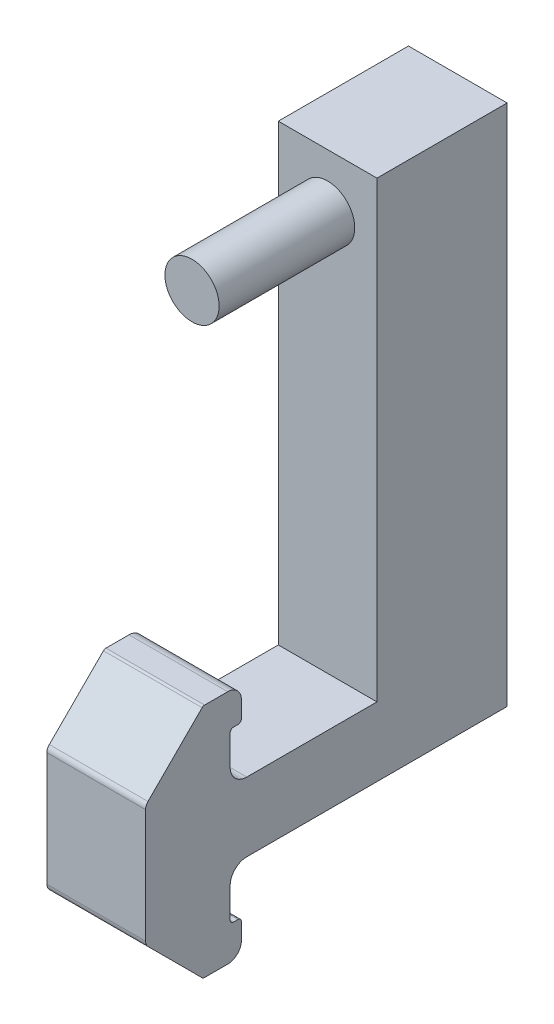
ISO-10303-21;
HEADER;
FILE_DESCRIPTION(('STEP AP214'),'2;1');
FILE_NAME('part.step','',(''),(''),'','','');
FILE_SCHEMA(('AUTOMOTIVE_DESIGN { 1 0 10303 214 1 1 1 1 }'));
ENDSEC;
DATA;
#1=APPLICATION_CONTEXT('core data for automotive mechanical design processes');
#2=APPLICATION_PROTOCOL_DEFINITION('international standard','automotive_design',2000,#1);
#3=PRODUCT_CONTEXT('',#1,'mechanical');
#4=PRODUCT('Part','Part','',(#3));
#5=PRODUCT_RELATED_PRODUCT_CATEGORY('part','',(#4));
#6=PRODUCT_DEFINITION_FORMATION('','',#4);
#7=PRODUCT_DEFINITION_CONTEXT('part definition',#1,'design');
#8=PRODUCT_DEFINITION('design','',#6,#7);
#9=PRODUCT_DEFINITION_SHAPE('','',#8);
#10=(LENGTH_UNIT() NAMED_UNIT(*) SI_UNIT(.MILLI.,.METRE.));
#11=(NAMED_UNIT(*) PLANE_ANGLE_UNIT() SI_UNIT($,.RADIAN.));
#12=(NAMED_UNIT(*) SI_UNIT($,.STERADIAN.) SOLID_ANGLE_UNIT());
#13=UNCERTAINTY_MEASURE_WITH_UNIT(LENGTH_MEASURE(1.E-05),#10,'distance_accuracy_value','');
#14=(GEOMETRIC_REPRESENTATION_CONTEXT(3) GLOBAL_UNCERTAINTY_ASSIGNED_CONTEXT((#13)) GLOBAL_UNIT_ASSIGNED_CONTEXT((#10,
#11,#12)) REPRESENTATION_CONTEXT('',''));
#15=CARTESIAN_POINT('',(0.,0.,0.));
#16=DIRECTION('',(0.,0.,1.));
#17=DIRECTION('',(1.,0.,0.));
#18=AXIS2_PLACEMENT_3D('',#15,#16,#17);
#19=CARTESIAN_POINT('',(0.,0.,12.5));
#20=DIRECTION('',(0.,0.,-1.));
#21=DIRECTION('',(-1.,0.,0.));
#22=AXIS2_PLACEMENT_3D('',#19,#20,#21);
#23=CYLINDRICAL_SURFACE('',#22,2.5);
#24=CARTESIAN_POINT('',(0.,0.,12.5));
#25=DIRECTION('',(0.,0.,1.));
#26=DIRECTION('',(1.,0.,0.));
#27=AXIS2_PLACEMENT_3D('',#24,#25,#26);
#28=CIRCLE('',#27,2.5);
#29=CARTESIAN_POINT('',(2.5,0.,12.5));
#30=VERTEX_POINT('',#29);
#31=EDGE_CURVE('E11',#30,#30,#28,.T.);
#32=ORIENTED_EDGE('',*,*,#31,.F.);
#33=EDGE_LOOP('',(#32));
#34=FACE_BOUND('',#33,.T.);
#35=CARTESIAN_POINT('',(0.,0.,0.));
#36=DIRECTION('',(0.,0.,1.));
#37=DIRECTION('',(1.,0.,0.));
#38=AXIS2_PLACEMENT_3D('',#35,#36,#37);
#39=CIRCLE('',#38,2.5);
#40=CARTESIAN_POINT('',(2.5,0.,0.));
#41=VERTEX_POINT('',#40);
#42=EDGE_CURVE('E44',#41,#41,#39,.T.);
#43=ORIENTED_EDGE('',*,*,#42,.T.);
#44=EDGE_LOOP('',(#43));
#45=FACE_BOUND('',#44,.T.);
#46=ADVANCED_FACE('F41',(#34,#45),#23,.T.);
#47=CARTESIAN_POINT('',(0.,0.,12.5));
#48=DIRECTION('',(0.,0.,1.));
#49=DIRECTION('',(1.,0.,0.));
#50=AXIS2_PLACEMENT_3D('',#47,#48,#49);
#51=PLANE('',#50);
#52=ORIENTED_EDGE('',*,*,#31,.T.);
#53=EDGE_LOOP('',(#52));
#54=FACE_BOUND('',#53,.T.);
#55=ADVANCED_FACE('F122',(#54),#51,.T.);
#56=CARTESIAN_POINT('',(-4.54662107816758,5.,-12.));
#57=DIRECTION('',(1.,0.,0.));
#58=DIRECTION('',(0.,0.,-1.));
#59=AXIS2_PLACEMENT_3D('',#56,#57,#58);
#60=PLANE('',#59);
#61=DIRECTION('',(0.,1.,0.));
#62=VECTOR('',#61,1.);
#63=CARTESIAN_POINT('',(-4.54662107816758,0.,-12.));
#64=LINE('',#63,#62);
#65=CARTESIAN_POINT('',(-4.54662107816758,-43.1849999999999,-12.));
#66=VERTEX_POINT('',#65);
#67=CARTESIAN_POINT('',(-4.54662107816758,5.,-12.));
#68=VERTEX_POINT('',#67);
#69=EDGE_CURVE('E99',#66,#68,#64,.T.);
#70=ORIENTED_EDGE('',*,*,#69,.F.);
#71=DIRECTION('',(0.,0.,1.));
#72=VECTOR('',#71,1.);
#73=CARTESIAN_POINT('',(-4.54662107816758,-43.1849999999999,0.));
#74=LINE('',#73,#72);
#75=CARTESIAN_POINT('',(-4.54662107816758,-43.1849999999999,12.));
#76=VERTEX_POINT('',#75);
#77=EDGE_CURVE('E444',#66,#76,#74,.T.);
#78=ORIENTED_EDGE('',*,*,#77,.T.);
#79=CARTESIAN_POINT('',(-4.54662107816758,-44.7149999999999,12.));
#80=DIRECTION('',(1.,0.,0.));
#81=DIRECTION('',(0.,0.,-1.));
#82=AXIS2_PLACEMENT_3D('',#79,#80,#81);
#83=CIRCLE('',#82,1.53);
#84=CARTESIAN_POINT('',(-4.54662107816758,-44.7149999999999,13.53));
#85=VERTEX_POINT('',#84);
#86=EDGE_CURVE('E448',#76,#85,#83,.T.);
#87=ORIENTED_EDGE('',*,*,#86,.T.);
#88=DIRECTION('',(0.,-1.,0.));
#89=VECTOR('',#88,1.);
#90=CARTESIAN_POINT('',(-4.54662107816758,-47.4649999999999,13.53));
#91=LINE('',#90,#89);
#92=CARTESIAN_POINT('',(-4.54662107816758,-47.4649999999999,13.53));
#93=VERTEX_POINT('',#92);
#94=EDGE_CURVE('E787',#85,#93,#91,.T.);
#95=ORIENTED_EDGE('',*,*,#94,.T.);
#96=CARTESIAN_POINT('',(-4.54662107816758,-47.4649999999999,13.21));
#97=DIRECTION('',(1.,0.,0.));
#98=DIRECTION('',(0.,0.,-1.));
#99=AXIS2_PLACEMENT_3D('',#96,#97,#98);
#100=CIRCLE('',#99,0.320000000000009);
#101=CARTESIAN_POINT('',(-4.54662107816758,-47.7849999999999,13.21));
#102=VERTEX_POINT('',#101);
#103=EDGE_CURVE('E789',#93,#102,#100,.T.);
#104=ORIENTED_EDGE('',*,*,#103,.T.);
#105=DIRECTION('',(0.,-1.04083408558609E-13,-1.));
#106=VECTOR('',#105,1.);
#107=CARTESIAN_POINT('',(-4.54662107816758,-47.785,12.81));
#108=LINE('',#107,#106);
#109=CARTESIAN_POINT('',(-4.54662107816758,-47.785,12.81));
#110=VERTEX_POINT('',#109);
#111=EDGE_CURVE('E791',#102,#110,#108,.T.);
#112=ORIENTED_EDGE('',*,*,#111,.T.);
#113=CARTESIAN_POINT('',(-4.54662107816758,-48.105,12.8100000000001));
#114=DIRECTION('',(1.,0.,0.));
#115=DIRECTION('',(0.,0.,-1.));
#116=AXIS2_PLACEMENT_3D('',#113,#114,#115);
#117=CIRCLE('',#116,0.320000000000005);
#118=CARTESIAN_POINT('',(-4.54662107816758,-48.105,12.4900000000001));
#119=VERTEX_POINT('',#118);
#120=EDGE_CURVE('E697',#110,#119,#117,.F.);
#121=ORIENTED_EDGE('',*,*,#120,.T.);
#122=DIRECTION('',(0.,-1.,0.));
#123=VECTOR('',#122,1.);
#124=CARTESIAN_POINT('',(-4.54662107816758,-49.605,12.4900000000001));
#125=LINE('',#124,#123);
#126=CARTESIAN_POINT('',(-4.54662107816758,-49.605,12.4900000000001));
#127=VERTEX_POINT('',#126);
#128=EDGE_CURVE('E694',#119,#127,#125,.T.);
#129=ORIENTED_EDGE('',*,*,#128,.T.);
#130=CARTESIAN_POINT('',(-4.54662107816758,-49.605,13.7600000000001));
#131=DIRECTION('',(1.,0.,0.));
#132=DIRECTION('',(0.,0.,-1.));
#133=AXIS2_PLACEMENT_3D('',#130,#131,#132);
#134=CIRCLE('',#133,1.27);
#135=CARTESIAN_POINT('',(-4.54662107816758,-50.875,13.7600000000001));
#136=VERTEX_POINT('',#135);
#137=EDGE_CURVE('E564',#127,#136,#134,.F.);
#138=ORIENTED_EDGE('',*,*,#137,.T.);
#139=DIRECTION('',(0.,0.,1.));
#140=VECTOR('',#139,1.);
#141=CARTESIAN_POINT('',(-4.54662107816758,-50.875,15.8900000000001));
#142=LINE('',#141,#140);
#143=CARTESIAN_POINT('',(-4.54662107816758,-50.875,15.8900000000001));
#144=VERTEX_POINT('',#143);
#145=EDGE_CURVE('E406',#136,#144,#142,.T.);
#146=ORIENTED_EDGE('',*,*,#145,.T.);
#147=CARTESIAN_POINT('',(-4.54662107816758,-50.555,15.8900000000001));
#148=DIRECTION('',(1.,0.,0.));
#149=DIRECTION('',(0.,0.,-1.));
#150=AXIS2_PLACEMENT_3D('',#147,#148,#149);
#151=CIRCLE('',#150,0.320000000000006);
#152=CARTESIAN_POINT('',(-4.54662107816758,-50.7812741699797,16.1162741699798));
#153=VERTEX_POINT('',#152);
#154=EDGE_CURVE('E420',#144,#153,#151,.F.);
#155=ORIENTED_EDGE('',*,*,#154,.T.);
#156=DIRECTION('',(0.,0.707106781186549,0.707106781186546));
#157=VECTOR('',#156,1.);
#158=CARTESIAN_POINT('',(-4.54662107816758,-45.7888153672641,21.1087329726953));
#159=LINE('',#158,#157);
#160=CARTESIAN_POINT('',(-4.54662107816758,-45.7888153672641,21.1087329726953));
#161=VERTEX_POINT('',#160);
#162=EDGE_CURVE('E422',#153,#161,#159,.T.);
#163=ORIENTED_EDGE('',*,*,#162,.T.);
#164=CARTESIAN_POINT('',(-4.54662107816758,-45.25,20.5699176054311));
#165=DIRECTION('',(1.,0.,0.));
#166=DIRECTION('',(0.,0.,-1.));
#167=AXIS2_PLACEMENT_3D('',#164,#165,#166);
#168=CIRCLE('',#167,0.761999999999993);
#169=CARTESIAN_POINT('',(-4.54662107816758,-45.25,21.3319176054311));
#170=VERTEX_POINT('',#169);
#171=EDGE_CURVE('E483',#161,#170,#168,.F.);
#172=ORIENTED_EDGE('',*,*,#171,.T.);
#173=DIRECTION('',(0.,1.,0.));
#174=VECTOR('',#173,1.);
#175=CARTESIAN_POINT('',(-4.54662107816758,-34.75,21.3319176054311));
#176=LINE('',#175,#174);
#177=CARTESIAN_POINT('',(-4.54662107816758,-34.75,21.3319176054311));
#178=VERTEX_POINT('',#177);
#179=EDGE_CURVE('E480',#170,#178,#176,.T.);
#180=ORIENTED_EDGE('',*,*,#179,.T.);
#181=CARTESIAN_POINT('',(-4.54662107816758,-34.75,20.5699176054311));
#182=DIRECTION('',(1.,0.,0.));
#183=DIRECTION('',(0.,0.,-1.));
#184=AXIS2_PLACEMENT_3D('',#181,#182,#183);
#185=CIRCLE('',#184,0.761999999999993);
#186=CARTESIAN_POINT('',(-4.54662107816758,-34.2111846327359,21.1087329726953));
#187=VERTEX_POINT('',#186);
#188=EDGE_CURVE('E477',#178,#187,#185,.F.);
#189=ORIENTED_EDGE('',*,*,#188,.T.);
#190=DIRECTION('',(0.,0.70710678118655,-0.707106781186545));
#191=VECTOR('',#190,1.);
#192=CARTESIAN_POINT('',(-4.54662107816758,-29.2187258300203,16.1162741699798));
#193=LINE('',#192,#191);
#194=CARTESIAN_POINT('',(-4.54662107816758,-29.2187258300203,16.1162741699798));
#195=VERTEX_POINT('',#194);
#196=EDGE_CURVE('E474',#187,#195,#193,.T.);
#197=ORIENTED_EDGE('',*,*,#196,.T.);
#198=CARTESIAN_POINT('',(-4.54662107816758,-29.4450000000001,15.89));
#199=DIRECTION('',(1.,0.,0.));
#200=DIRECTION('',(0.,0.,-1.));
#201=AXIS2_PLACEMENT_3D('',#198,#199,#200);
#202=CIRCLE('',#201,0.320000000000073);
#203=CARTESIAN_POINT('',(-4.54662107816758,-29.125,15.89));
#204=VERTEX_POINT('',#203);
#205=EDGE_CURVE('E471',#195,#204,#202,.F.);
#206=ORIENTED_EDGE('',*,*,#205,.T.);
#207=DIRECTION('',(0.,0.,-1.));
#208=VECTOR('',#207,1.);
#209=CARTESIAN_POINT('',(-4.54662107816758,-29.125,15.89));
#210=LINE('',#209,#208);
#211=CARTESIAN_POINT('',(-4.54662107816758,-29.125,13.76));
#212=VERTEX_POINT('',#211);
#213=EDGE_CURVE('E468',#204,#212,#210,.T.);
#214=ORIENTED_EDGE('',*,*,#213,.T.);
#215=CARTESIAN_POINT('',(-4.54662107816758,-30.395,13.76));
#216=DIRECTION('',(1.,0.,0.));
#217=DIRECTION('',(0.,0.,-1.));
#218=AXIS2_PLACEMENT_3D('',#215,#216,#217);
#219=CIRCLE('',#218,1.26999999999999);
#220=CARTESIAN_POINT('',(-4.54662107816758,-30.395,12.49));
#221=VERTEX_POINT('',#220);
#222=EDGE_CURVE('E465',#212,#221,#219,.F.);
#223=ORIENTED_EDGE('',*,*,#222,.T.);
#224=DIRECTION('',(0.,-1.,0.));
#225=VECTOR('',#224,1.);
#226=CARTESIAN_POINT('',(-4.54662107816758,-30.395,12.49));
#227=LINE('',#226,#225);
#228=CARTESIAN_POINT('',(-4.54662107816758,-31.895,12.49));
#229=VERTEX_POINT('',#228);
#230=EDGE_CURVE('E462',#221,#229,#227,.T.);
#231=ORIENTED_EDGE('',*,*,#230,.T.);
#232=CARTESIAN_POINT('',(-4.54662107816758,-31.895,12.81));
#233=DIRECTION('',(1.,0.,0.));
#234=DIRECTION('',(0.,0.,-1.));
#235=AXIS2_PLACEMENT_3D('',#232,#233,#234);
#236=CIRCLE('',#235,0.32);
#237=CARTESIAN_POINT('',(-4.54662107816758,-32.215,12.81));
#238=VERTEX_POINT('',#237);
#239=EDGE_CURVE('E459',#229,#238,#236,.F.);
#240=ORIENTED_EDGE('',*,*,#239,.T.);
#241=DIRECTION('',(0.,0.,1.));
#242=VECTOR('',#241,1.);
#243=CARTESIAN_POINT('',(-4.54662107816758,-32.215,12.81));
#244=LINE('',#243,#242);
#245=CARTESIAN_POINT('',(-4.54662107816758,-32.215,13.21));
#246=VERTEX_POINT('',#245);
#247=EDGE_CURVE('E456',#238,#246,#244,.T.);
#248=ORIENTED_EDGE('',*,*,#247,.T.);
#249=CARTESIAN_POINT('',(-4.54662107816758,-32.535,13.21));
#250=DIRECTION('',(1.,0.,0.));
#251=DIRECTION('',(0.,0.,-1.));
#252=AXIS2_PLACEMENT_3D('',#249,#250,#251);
#253=CIRCLE('',#252,0.32);
#254=CARTESIAN_POINT('',(-4.54662107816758,-32.535,13.53));
#255=VERTEX_POINT('',#254);
#256=EDGE_CURVE('E453',#246,#255,#253,.T.);
#257=ORIENTED_EDGE('',*,*,#256,.T.);
#258=DIRECTION('',(0.,-1.,0.));
#259=VECTOR('',#258,1.);
#260=CARTESIAN_POINT('',(-4.54662107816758,-32.535,13.53));
#261=LINE('',#260,#259);
#262=CARTESIAN_POINT('',(-4.54662107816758,-35.285,13.53));
#263=VERTEX_POINT('',#262);
#264=EDGE_CURVE('E446',#255,#263,#261,.T.);
#265=ORIENTED_EDGE('',*,*,#264,.T.);
#266=CARTESIAN_POINT('',(-4.54662107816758,-35.285,12.));
#267=DIRECTION('',(1.,0.,0.));
#268=DIRECTION('',(0.,0.,-1.));
#269=AXIS2_PLACEMENT_3D('',#266,#267,#268);
#270=CIRCLE('',#269,1.53);
#271=CARTESIAN_POINT('',(-4.54662107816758,-36.815,12.));
#272=VERTEX_POINT('',#271);
#273=EDGE_CURVE('E441',#263,#272,#270,.T.);
#274=ORIENTED_EDGE('',*,*,#273,.T.);
#275=DIRECTION('',(0.,0.,-1.));
#276=VECTOR('',#275,1.);
#277=CARTESIAN_POINT('',(-4.54662107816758,-36.815,12.));
#278=LINE('',#277,#276);
#279=CARTESIAN_POINT('',(-4.54662107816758,-36.815,0.));
#280=VERTEX_POINT('',#279);
#281=EDGE_CURVE('E437',#272,#280,#278,.T.);
#282=ORIENTED_EDGE('',*,*,#281,.T.);
#283=DIRECTION('',(0.,1.,0.));
#284=VECTOR('',#283,1.);
#285=CARTESIAN_POINT('',(-4.54662107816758,5.,0.));
#286=LINE('',#285,#284);
#287=CARTESIAN_POINT('',(-4.54662107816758,5.,0.));
#288=VERTEX_POINT('',#287);
#289=EDGE_CURVE('E89',#280,#288,#286,.T.);
#290=ORIENTED_EDGE('',*,*,#289,.T.);
#291=DIRECTION('',(0.,0.,1.));
#292=VECTOR('',#291,1.);
#293=CARTESIAN_POINT('',(-4.54662107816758,5.,-12.));
#294=LINE('',#293,#292);
#295=EDGE_CURVE('E84',#68,#288,#294,.T.);
#296=ORIENTED_EDGE('',*,*,#295,.F.);
#297=EDGE_LOOP('',(#70,#78,#87,#95,#104,#112,#121,#129,#138,#146,#155,#163,#172,#180,#189,#197,
#206,#214,#223,#231,#240,#248,#257,#265,#274,#282,#290,#296));
#298=FACE_BOUND('',#297,.T.);
#299=ADVANCED_FACE('F127',(#298),#60,.F.);
#300=CARTESIAN_POINT('',(4.54662107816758,5.,-12.));
#301=DIRECTION('',(0.,-1.,0.));
#302=DIRECTION('',(0.,0.,-1.));
#303=AXIS2_PLACEMENT_3D('',#300,#301,#302);
#304=PLANE('',#303);
#305=DIRECTION('',(1.,0.,0.));
#306=VECTOR('',#305,1.);
#307=CARTESIAN_POINT('',(4.54662107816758,5.,0.));
#308=LINE('',#307,#306);
#309=CARTESIAN_POINT('',(4.54662107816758,5.,0.));
#310=VERTEX_POINT('',#309);
#311=EDGE_CURVE('E79',#288,#310,#308,.T.);
#312=ORIENTED_EDGE('',*,*,#311,.T.);
#313=DIRECTION('',(0.,0.,1.));
#314=VECTOR('',#313,1.);
#315=CARTESIAN_POINT('',(4.54662107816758,5.,-12.));
#316=LINE('',#315,#314);
#317=CARTESIAN_POINT('',(4.54662107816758,5.,-12.));
#318=VERTEX_POINT('',#317);
#319=EDGE_CURVE('E82',#318,#310,#316,.T.);
#320=ORIENTED_EDGE('',*,*,#319,.F.);
#321=DIRECTION('',(1.,0.,0.));
#322=VECTOR('',#321,1.);
#323=CARTESIAN_POINT('',(4.54662107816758,5.,-12.));
#324=LINE('',#323,#322);
#325=EDGE_CURVE('E95',#68,#318,#324,.T.);
#326=ORIENTED_EDGE('',*,*,#325,.F.);
#327=ORIENTED_EDGE('',*,*,#295,.T.);
#328=EDGE_LOOP('',(#312,#320,#326,#327));
#329=FACE_BOUND('',#328,.T.);
#330=ADVANCED_FACE('F80',(#329),#304,.F.);
#331=CARTESIAN_POINT('',(4.54662107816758,0.,-12.));
#332=DIRECTION('',(-1.,0.,0.));
#333=DIRECTION('',(0.,0.,1.));
#334=AXIS2_PLACEMENT_3D('',#331,#332,#333);
#335=PLANE('',#334);
#336=DIRECTION('',(0.,-1.,0.));
#337=VECTOR('',#336,1.);
#338=CARTESIAN_POINT('',(4.54662107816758,0.,0.));
#339=LINE('',#338,#337);
#340=CARTESIAN_POINT('',(4.54662107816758,-36.815,0.));
#341=VERTEX_POINT('',#340);
#342=EDGE_CURVE('E88',#310,#341,#339,.T.);
#343=ORIENTED_EDGE('',*,*,#342,.T.);
#344=DIRECTION('',(0.,0.,1.));
#345=VECTOR('',#344,1.);
#346=CARTESIAN_POINT('',(4.54662107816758,-36.815,12.));
#347=LINE('',#346,#345);
#348=CARTESIAN_POINT('',(4.54662107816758,-36.815,12.));
#349=VERTEX_POINT('',#348);
#350=EDGE_CURVE('E517',#341,#349,#347,.T.);
#351=ORIENTED_EDGE('',*,*,#350,.T.);
#352=CARTESIAN_POINT('',(4.54662107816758,-35.285,12.));
#353=DIRECTION('',(-1.,0.,0.));
#354=DIRECTION('',(0.,0.,-1.));
#355=AXIS2_PLACEMENT_3D('',#352,#353,#354);
#356=CIRCLE('',#355,1.53);
#357=CARTESIAN_POINT('',(4.54662107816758,-35.285,13.53));
#358=VERTEX_POINT('',#357);
#359=EDGE_CURVE('E519',#349,#358,#356,.T.);
#360=ORIENTED_EDGE('',*,*,#359,.T.);
#361=DIRECTION('',(0.,1.,0.));
#362=VECTOR('',#361,1.);
#363=CARTESIAN_POINT('',(4.54662107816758,-32.535,13.53));
#364=LINE('',#363,#362);
#365=CARTESIAN_POINT('',(4.54662107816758,-32.535,13.53));
#366=VERTEX_POINT('',#365);
#367=EDGE_CURVE('E522',#358,#366,#364,.T.);
#368=ORIENTED_EDGE('',*,*,#367,.T.);
#369=CARTESIAN_POINT('',(4.54662107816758,-32.535,13.21));
#370=DIRECTION('',(-1.,0.,0.));
#371=DIRECTION('',(0.,0.,-1.));
#372=AXIS2_PLACEMENT_3D('',#369,#370,#371);
#373=CIRCLE('',#372,0.32);
#374=CARTESIAN_POINT('',(4.54662107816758,-32.215,13.21));
#375=VERTEX_POINT('',#374);
#376=EDGE_CURVE('E525',#366,#375,#373,.T.);
#377=ORIENTED_EDGE('',*,*,#376,.T.);
#378=DIRECTION('',(0.,0.,-1.));
#379=VECTOR('',#378,1.);
#380=CARTESIAN_POINT('',(4.54662107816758,-32.215,12.81));
#381=LINE('',#380,#379);
#382=CARTESIAN_POINT('',(4.54662107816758,-32.215,12.81));
#383=VERTEX_POINT('',#382);
#384=EDGE_CURVE('E528',#375,#383,#381,.T.);
#385=ORIENTED_EDGE('',*,*,#384,.T.);
#386=CARTESIAN_POINT('',(4.54662107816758,-31.895,12.81));
#387=DIRECTION('',(1.,0.,0.));
#388=DIRECTION('',(0.,0.,1.));
#389=AXIS2_PLACEMENT_3D('',#386,#387,#388);
#390=CIRCLE('',#389,0.32);
#391=CARTESIAN_POINT('',(4.54662107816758,-31.895,12.49));
#392=VERTEX_POINT('',#391);
#393=EDGE_CURVE('E531',#383,#392,#390,.T.);
#394=ORIENTED_EDGE('',*,*,#393,.T.);
#395=DIRECTION('',(0.,1.,0.));
#396=VECTOR('',#395,1.);
#397=CARTESIAN_POINT('',(4.54662107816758,-30.395,12.49));
#398=LINE('',#397,#396);
#399=CARTESIAN_POINT('',(4.54662107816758,-30.395,12.49));
#400=VERTEX_POINT('',#399);
#401=EDGE_CURVE('E534',#392,#400,#398,.T.);
#402=ORIENTED_EDGE('',*,*,#401,.T.);
#403=CARTESIAN_POINT('',(4.54662107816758,-30.395,13.76));
#404=DIRECTION('',(1.,0.,0.));
#405=DIRECTION('',(0.,0.,1.));
#406=AXIS2_PLACEMENT_3D('',#403,#404,#405);
#407=CIRCLE('',#406,1.26999999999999);
#408=CARTESIAN_POINT('',(4.54662107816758,-29.125,13.76));
#409=VERTEX_POINT('',#408);
#410=EDGE_CURVE('E537',#400,#409,#407,.T.);
#411=ORIENTED_EDGE('',*,*,#410,.T.);
#412=DIRECTION('',(0.,0.,1.));
#413=VECTOR('',#412,1.);
#414=CARTESIAN_POINT('',(4.54662107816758,-29.125,15.89));
#415=LINE('',#414,#413);
#416=CARTESIAN_POINT('',(4.54662107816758,-29.125,15.89));
#417=VERTEX_POINT('',#416);
#418=EDGE_CURVE('E540',#409,#417,#415,.T.);
#419=ORIENTED_EDGE('',*,*,#418,.T.);
#420=CARTESIAN_POINT('',(4.54662107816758,-29.4450000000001,15.89));
#421=DIRECTION('',(1.,0.,0.));
#422=DIRECTION('',(0.,0.,1.));
#423=AXIS2_PLACEMENT_3D('',#420,#421,#422);
#424=CIRCLE('',#423,0.320000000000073);
#425=CARTESIAN_POINT('',(4.54662107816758,-29.2187258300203,16.1162741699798));
#426=VERTEX_POINT('',#425);
#427=EDGE_CURVE('E543',#417,#426,#424,.T.);
#428=ORIENTED_EDGE('',*,*,#427,.T.);
#429=DIRECTION('',(0.,-0.70710678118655,0.707106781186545));
#430=VECTOR('',#429,1.);
#431=CARTESIAN_POINT('',(4.54662107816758,-29.2187258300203,16.1162741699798));
#432=LINE('',#431,#430);
#433=CARTESIAN_POINT('',(4.54662107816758,-34.2111846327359,21.1087329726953));
#434=VERTEX_POINT('',#433);
#435=EDGE_CURVE('E546',#426,#434,#432,.T.);
#436=ORIENTED_EDGE('',*,*,#435,.T.);
#437=CARTESIAN_POINT('',(4.54662107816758,-34.75,20.5699176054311));
#438=DIRECTION('',(1.,0.,0.));
#439=DIRECTION('',(0.,0.,-1.));
#440=AXIS2_PLACEMENT_3D('',#437,#438,#439);
#441=CIRCLE('',#440,0.761999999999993);
#442=CARTESIAN_POINT('',(4.54662107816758,-34.75,21.3319176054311));
#443=VERTEX_POINT('',#442);
#444=EDGE_CURVE('E549',#434,#443,#441,.T.);
#445=ORIENTED_EDGE('',*,*,#444,.T.);
#446=DIRECTION('',(0.,-1.,0.));
#447=VECTOR('',#446,1.);
#448=CARTESIAN_POINT('',(4.54662107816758,-34.75,21.3319176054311));
#449=LINE('',#448,#447);
#450=CARTESIAN_POINT('',(4.54662107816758,-45.25,21.3319176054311));
#451=VERTEX_POINT('',#450);
#452=EDGE_CURVE('E552',#443,#451,#449,.T.);
#453=ORIENTED_EDGE('',*,*,#452,.T.);
#454=CARTESIAN_POINT('',(4.54662107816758,-45.25,20.5699176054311));
#455=DIRECTION('',(1.,0.,0.));
#456=DIRECTION('',(0.,0.,1.));
#457=AXIS2_PLACEMENT_3D('',#454,#455,#456);
#458=CIRCLE('',#457,0.761999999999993);
#459=CARTESIAN_POINT('',(4.54662107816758,-45.7888153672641,21.1087329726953));
#460=VERTEX_POINT('',#459);
#461=EDGE_CURVE('E555',#451,#460,#458,.T.);
#462=ORIENTED_EDGE('',*,*,#461,.T.);
#463=DIRECTION('',(0.,-0.707106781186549,-0.707106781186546));
#464=VECTOR('',#463,1.);
#465=CARTESIAN_POINT('',(4.54662107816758,-45.7888153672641,21.1087329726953));
#466=LINE('',#465,#464);
#467=CARTESIAN_POINT('',(4.54662107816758,-50.7812741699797,16.1162741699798));
#468=VERTEX_POINT('',#467);
#469=EDGE_CURVE('E558',#460,#468,#466,.T.);
#470=ORIENTED_EDGE('',*,*,#469,.T.);
#471=CARTESIAN_POINT('',(4.54662107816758,-50.555,15.8900000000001));
#472=DIRECTION('',(1.,0.,0.));
#473=DIRECTION('',(0.,0.,1.));
#474=AXIS2_PLACEMENT_3D('',#471,#472,#473);
#475=CIRCLE('',#474,0.320000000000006);
#476=CARTESIAN_POINT('',(4.54662107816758,-50.875,15.8900000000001));
#477=VERTEX_POINT('',#476);
#478=EDGE_CURVE('E488',#468,#477,#475,.T.);
#479=ORIENTED_EDGE('',*,*,#478,.T.);
#480=DIRECTION('',(0.,0.,-1.));
#481=VECTOR('',#480,1.);
#482=CARTESIAN_POINT('',(4.54662107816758,-50.875,15.8900000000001));
#483=LINE('',#482,#481);
#484=CARTESIAN_POINT('',(4.54662107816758,-50.875,13.7600000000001));
#485=VERTEX_POINT('',#484);
#486=EDGE_CURVE('E491',#477,#485,#483,.T.);
#487=ORIENTED_EDGE('',*,*,#486,.T.);
#488=CARTESIAN_POINT('',(4.54662107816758,-49.605,13.7600000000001));
#489=DIRECTION('',(1.,0.,0.));
#490=DIRECTION('',(0.,0.,-1.));
#491=AXIS2_PLACEMENT_3D('',#488,#489,#490);
#492=CIRCLE('',#491,1.27);
#493=CARTESIAN_POINT('',(4.54662107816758,-49.605,12.4900000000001));
#494=VERTEX_POINT('',#493);
#495=EDGE_CURVE('E494',#485,#494,#492,.T.);
#496=ORIENTED_EDGE('',*,*,#495,.T.);
#497=DIRECTION('',(0.,1.,0.));
#498=VECTOR('',#497,1.);
#499=CARTESIAN_POINT('',(4.54662107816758,-49.605,12.4900000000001));
#500=LINE('',#499,#498);
#501=CARTESIAN_POINT('',(4.54662107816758,-48.105,12.4900000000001));
#502=VERTEX_POINT('',#501);
#503=EDGE_CURVE('E497',#494,#502,#500,.T.);
#504=ORIENTED_EDGE('',*,*,#503,.T.);
#505=CARTESIAN_POINT('',(4.54662107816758,-48.105,12.8100000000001));
#506=DIRECTION('',(1.,0.,0.));
#507=DIRECTION('',(0.,0.,-1.));
#508=AXIS2_PLACEMENT_3D('',#505,#506,#507);
#509=CIRCLE('',#508,0.320000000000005);
#510=CARTESIAN_POINT('',(4.54662107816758,-47.785,12.81));
#511=VERTEX_POINT('',#510);
#512=EDGE_CURVE('E500',#502,#511,#509,.T.);
#513=ORIENTED_EDGE('',*,*,#512,.T.);
#514=DIRECTION('',(0.,1.04083408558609E-13,1.));
#515=VECTOR('',#514,1.);
#516=CARTESIAN_POINT('',(4.54662107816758,-47.785,12.81));
#517=LINE('',#516,#515);
#518=CARTESIAN_POINT('',(4.54662107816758,-47.7849999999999,13.21));
#519=VERTEX_POINT('',#518);
#520=EDGE_CURVE('E503',#511,#519,#517,.T.);
#521=ORIENTED_EDGE('',*,*,#520,.T.);
#522=CARTESIAN_POINT('',(4.54662107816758,-47.4649999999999,13.21));
#523=DIRECTION('',(-1.,0.,0.));
#524=DIRECTION('',(0.,0.,1.));
#525=AXIS2_PLACEMENT_3D('',#522,#523,#524);
#526=CIRCLE('',#525,0.320000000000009);
#527=CARTESIAN_POINT('',(4.54662107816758,-47.4649999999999,13.53));
#528=VERTEX_POINT('',#527);
#529=EDGE_CURVE('E506',#519,#528,#526,.T.);
#530=ORIENTED_EDGE('',*,*,#529,.T.);
#531=DIRECTION('',(0.,1.,0.));
#532=VECTOR('',#531,1.);
#533=CARTESIAN_POINT('',(4.54662107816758,-47.4649999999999,13.53));
#534=LINE('',#533,#532);
#535=CARTESIAN_POINT('',(4.54662107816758,-44.7149999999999,13.53));
#536=VERTEX_POINT('',#535);
#537=EDGE_CURVE('E509',#528,#536,#534,.T.);
#538=ORIENTED_EDGE('',*,*,#537,.T.);
#539=CARTESIAN_POINT('',(4.54662107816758,-44.7149999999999,12.));
#540=DIRECTION('',(-1.,0.,0.));
#541=DIRECTION('',(0.,0.,1.));
#542=AXIS2_PLACEMENT_3D('',#539,#540,#541);
#543=CIRCLE('',#542,1.53);
#544=CARTESIAN_POINT('',(4.54662107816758,-43.1849999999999,12.));
#545=VERTEX_POINT('',#544);
#546=EDGE_CURVE('E512',#536,#545,#543,.T.);
#547=ORIENTED_EDGE('',*,*,#546,.T.);
#548=DIRECTION('',(0.,0.,-1.));
#549=VECTOR('',#548,1.);
#550=CARTESIAN_POINT('',(4.54662107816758,-43.1849999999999,0.));
#551=LINE('',#550,#549);
#552=CARTESIAN_POINT('',(4.54662107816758,-43.1849999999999,-12.));
#553=VERTEX_POINT('',#552);
#554=EDGE_CURVE('E515',#545,#553,#551,.T.);
#555=ORIENTED_EDGE('',*,*,#554,.T.);
#556=DIRECTION('',(0.,-1.,0.));
#557=VECTOR('',#556,1.);
#558=CARTESIAN_POINT('',(4.54662107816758,0.,-12.));
#559=LINE('',#558,#557);
#560=EDGE_CURVE('E64',#318,#553,#559,.T.);
#561=ORIENTED_EDGE('',*,*,#560,.F.);
#562=ORIENTED_EDGE('',*,*,#319,.T.);
#563=EDGE_LOOP('',(#343,#351,#360,#368,#377,#385,#394,#402,#411,#419,#428,#436,#445,#453,#462,
#470,#479,#487,#496,#504,#513,#521,#530,#538,#547,#555,#561,#562));
#564=FACE_BOUND('',#563,.T.);
#565=ADVANCED_FACE('F92',(#564),#335,.F.);
#566=CARTESIAN_POINT('',(0.,0.,-12.));
#567=DIRECTION('',(0.,0.,-1.));
#568=DIRECTION('',(-1.,0.,0.));
#569=AXIS2_PLACEMENT_3D('',#566,#567,#568);
#570=PLANE('',#569);
#571=ORIENTED_EDGE('',*,*,#560,.T.);
#572=DIRECTION('',(1.,0.,0.));
#573=VECTOR('',#572,1.);
#574=CARTESIAN_POINT('',(-44.3471139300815,-43.1849999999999,-12.));
#575=LINE('',#574,#573);
#576=EDGE_CURVE('E433',#66,#553,#575,.T.);
#577=ORIENTED_EDGE('',*,*,#576,.F.);
#578=ORIENTED_EDGE('',*,*,#69,.T.);
#579=ORIENTED_EDGE('',*,*,#325,.T.);
#580=EDGE_LOOP('',(#571,#577,#578,#579));
#581=FACE_BOUND('',#580,.T.);
#582=ADVANCED_FACE('F109',(#581),#570,.T.);
#583=CARTESIAN_POINT('',(0.,0.,0.));
#584=DIRECTION('',(0.,0.,-1.));
#585=DIRECTION('',(-1.,0.,0.));
#586=AXIS2_PLACEMENT_3D('',#583,#584,#585);
#587=PLANE('',#586);
#588=ORIENTED_EDGE('',*,*,#42,.F.);
#589=EDGE_LOOP('',(#588));
#590=FACE_BOUND('',#589,.T.);
#591=ORIENTED_EDGE('',*,*,#289,.F.);
#592=DIRECTION('',(1.,0.,0.));
#593=VECTOR('',#592,1.);
#594=CARTESIAN_POINT('',(-44.3471139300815,-36.815,0.));
#595=LINE('',#594,#593);
#596=EDGE_CURVE('E55',#280,#341,#595,.T.);
#597=ORIENTED_EDGE('',*,*,#596,.T.);
#598=ORIENTED_EDGE('',*,*,#342,.F.);
#599=ORIENTED_EDGE('',*,*,#311,.F.);
#600=EDGE_LOOP('',(#591,#597,#598,#599));
#601=FACE_BOUND('',#600,.T.);
#602=ADVANCED_FACE('F97',(#590,#601),#587,.F.);
#603=CARTESIAN_POINT('',(-44.3471139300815,-50.555,15.8900000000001));
#604=DIRECTION('',(1.,0.,0.));
#605=DIRECTION('',(0.,0.,-1.));
#606=AXIS2_PLACEMENT_3D('',#603,#604,#605);
#607=CYLINDRICAL_SURFACE('',#606,0.320000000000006);
#608=ORIENTED_EDGE('',*,*,#154,.F.);
#609=DIRECTION('',(1.,0.,0.));
#610=VECTOR('',#609,1.);
#611=CARTESIAN_POINT('',(-44.3471139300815,-50.875,15.8900000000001));
#612=LINE('',#611,#610);
#613=EDGE_CURVE('E414',#144,#477,#612,.T.);
#614=ORIENTED_EDGE('',*,*,#613,.T.);
#615=ORIENTED_EDGE('',*,*,#478,.F.);
#616=DIRECTION('',(1.,0.,0.));
#617=VECTOR('',#616,1.);
#618=CARTESIAN_POINT('',(-44.3471139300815,-50.7812741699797,16.1162741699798));
#619=LINE('',#618,#617);
#620=EDGE_CURVE('E561',#153,#468,#619,.T.);
#621=ORIENTED_EDGE('',*,*,#620,.F.);
#622=EDGE_LOOP('',(#608,#614,#615,#621));
#623=FACE_BOUND('',#622,.T.);
#624=ADVANCED_FACE('F108',(#623),#607,.T.);
#625=CARTESIAN_POINT('',(-44.3471139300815,-45.7888153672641,21.1087329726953));
#626=DIRECTION('',(0.,-0.707106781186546,0.707106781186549));
#627=DIRECTION('',(0.,-0.707106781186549,-0.707106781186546));
#628=AXIS2_PLACEMENT_3D('',#625,#626,#627);
#629=PLANE('',#628);
#630=ORIENTED_EDGE('',*,*,#162,.F.);
#631=ORIENTED_EDGE('',*,*,#620,.T.);
#632=ORIENTED_EDGE('',*,*,#469,.F.);
#633=DIRECTION('',(1.,0.,0.));
#634=VECTOR('',#633,1.);
#635=CARTESIAN_POINT('',(-44.3471139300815,-45.7888153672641,21.1087329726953));
#636=LINE('',#635,#634);
#637=EDGE_CURVE('E565',#161,#460,#636,.T.);
#638=ORIENTED_EDGE('',*,*,#637,.F.);
#639=EDGE_LOOP('',(#630,#631,#632,#638));
#640=FACE_BOUND('',#639,.T.);
#641=ADVANCED_FACE('F115',(#640),#629,.T.);
#642=CARTESIAN_POINT('',(-44.3471139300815,-45.25,20.5699176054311));
#643=DIRECTION('',(1.,0.,0.));
#644=DIRECTION('',(0.,0.,-1.));
#645=AXIS2_PLACEMENT_3D('',#642,#643,#644);
#646=CYLINDRICAL_SURFACE('',#645,0.761999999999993);
#647=ORIENTED_EDGE('',*,*,#171,.F.);
#648=ORIENTED_EDGE('',*,*,#637,.T.);
#649=ORIENTED_EDGE('',*,*,#461,.F.);
#650=DIRECTION('',(1.,0.,0.));
#651=VECTOR('',#650,1.);
#652=CARTESIAN_POINT('',(-44.3471139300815,-45.25,21.3319176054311));
#653=LINE('',#652,#651);
#654=EDGE_CURVE('E568',#170,#451,#653,.T.);
#655=ORIENTED_EDGE('',*,*,#654,.F.);
#656=EDGE_LOOP('',(#647,#648,#649,#655));
#657=FACE_BOUND('',#656,.T.);
#658=ADVANCED_FACE('F166',(#657),#646,.T.);
#659=CARTESIAN_POINT('',(-44.3471139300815,-34.75,21.3319176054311));
#660=DIRECTION('',(0.,0.,1.));
#661=DIRECTION('',(1.,0.,0.));
#662=AXIS2_PLACEMENT_3D('',#659,#660,#661);
#663=PLANE('',#662);
#664=ORIENTED_EDGE('',*,*,#179,.F.);
#665=ORIENTED_EDGE('',*,*,#654,.T.);
#666=ORIENTED_EDGE('',*,*,#452,.F.);
#667=DIRECTION('',(1.,0.,0.));
#668=VECTOR('',#667,1.);
#669=CARTESIAN_POINT('',(-44.3471139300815,-34.75,21.3319176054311));
#670=LINE('',#669,#668);
#671=EDGE_CURVE('E571',#178,#443,#670,.T.);
#672=ORIENTED_EDGE('',*,*,#671,.F.);
#673=EDGE_LOOP('',(#664,#665,#666,#672));
#674=FACE_BOUND('',#673,.T.);
#675=ADVANCED_FACE('F176',(#674),#663,.T.);
#676=CARTESIAN_POINT('',(-44.3471139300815,-34.75,20.5699176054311));
#677=DIRECTION('',(1.,0.,0.));
#678=DIRECTION('',(0.,0.,-1.));
#679=AXIS2_PLACEMENT_3D('',#676,#677,#678);
#680=CYLINDRICAL_SURFACE('',#679,0.761999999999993);
#681=ORIENTED_EDGE('',*,*,#188,.F.);
#682=ORIENTED_EDGE('',*,*,#671,.T.);
#683=ORIENTED_EDGE('',*,*,#444,.F.);
#684=DIRECTION('',(1.,0.,0.));
#685=VECTOR('',#684,1.);
#686=CARTESIAN_POINT('',(-44.3471139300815,-34.2111846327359,21.1087329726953));
#687=LINE('',#686,#685);
#688=EDGE_CURVE('E574',#187,#434,#687,.T.);
#689=ORIENTED_EDGE('',*,*,#688,.F.);
#690=EDGE_LOOP('',(#681,#682,#683,#689));
#691=FACE_BOUND('',#690,.T.);
#692=ADVANCED_FACE('F186',(#691),#680,.T.);
#693=CARTESIAN_POINT('',(-44.3471139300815,-29.2187258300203,16.1162741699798));
#694=DIRECTION('',(0.,0.707106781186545,0.70710678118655));
#695=DIRECTION('',(0.,-0.70710678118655,0.707106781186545));
#696=AXIS2_PLACEMENT_3D('',#693,#694,#695);
#697=PLANE('',#696);
#698=ORIENTED_EDGE('',*,*,#196,.F.);
#699=ORIENTED_EDGE('',*,*,#688,.T.);
#700=ORIENTED_EDGE('',*,*,#435,.F.);
#701=DIRECTION('',(1.,0.,0.));
#702=VECTOR('',#701,1.);
#703=CARTESIAN_POINT('',(-44.3471139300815,-29.2187258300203,16.1162741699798));
#704=LINE('',#703,#702);
#705=EDGE_CURVE('E577',#195,#426,#704,.T.);
#706=ORIENTED_EDGE('',*,*,#705,.F.);
#707=EDGE_LOOP('',(#698,#699,#700,#706));
#708=FACE_BOUND('',#707,.T.);
#709=ADVANCED_FACE('F196',(#708),#697,.T.);
#710=CARTESIAN_POINT('',(-44.3471139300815,-29.4450000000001,15.89));
#711=DIRECTION('',(1.,0.,0.));
#712=DIRECTION('',(0.,0.,-1.));
#713=AXIS2_PLACEMENT_3D('',#710,#711,#712);
#714=CYLINDRICAL_SURFACE('',#713,0.320000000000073);
#715=ORIENTED_EDGE('',*,*,#205,.F.);
#716=ORIENTED_EDGE('',*,*,#705,.T.);
#717=ORIENTED_EDGE('',*,*,#427,.F.);
#718=DIRECTION('',(1.,0.,0.));
#719=VECTOR('',#718,1.);
#720=CARTESIAN_POINT('',(-44.3471139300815,-29.125,15.89));
#721=LINE('',#720,#719);
#722=EDGE_CURVE('E580',#204,#417,#721,.T.);
#723=ORIENTED_EDGE('',*,*,#722,.F.);
#724=EDGE_LOOP('',(#715,#716,#717,#723));
#725=FACE_BOUND('',#724,.T.);
#726=ADVANCED_FACE('F206',(#725),#714,.T.);
#727=CARTESIAN_POINT('',(-44.3471139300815,-29.125,15.89));
#728=DIRECTION('',(0.,1.,0.));
#729=DIRECTION('',(0.,0.,1.));
#730=AXIS2_PLACEMENT_3D('',#727,#728,#729);
#731=PLANE('',#730);
#732=ORIENTED_EDGE('',*,*,#213,.F.);
#733=ORIENTED_EDGE('',*,*,#722,.T.);
#734=ORIENTED_EDGE('',*,*,#418,.F.);
#735=DIRECTION('',(1.,0.,0.));
#736=VECTOR('',#735,1.);
#737=CARTESIAN_POINT('',(-44.3471139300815,-29.125,13.76));
#738=LINE('',#737,#736);
#739=EDGE_CURVE('E583',#212,#409,#738,.T.);
#740=ORIENTED_EDGE('',*,*,#739,.F.);
#741=EDGE_LOOP('',(#732,#733,#734,#740));
#742=FACE_BOUND('',#741,.T.);
#743=ADVANCED_FACE('F216',(#742),#731,.T.);
#744=CARTESIAN_POINT('',(-44.3471139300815,-30.395,13.76));
#745=DIRECTION('',(1.,0.,0.));
#746=DIRECTION('',(0.,0.,-1.));
#747=AXIS2_PLACEMENT_3D('',#744,#745,#746);
#748=CYLINDRICAL_SURFACE('',#747,1.26999999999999);
#749=ORIENTED_EDGE('',*,*,#222,.F.);
#750=ORIENTED_EDGE('',*,*,#739,.T.);
#751=ORIENTED_EDGE('',*,*,#410,.F.);
#752=DIRECTION('',(1.,0.,0.));
#753=VECTOR('',#752,1.);
#754=CARTESIAN_POINT('',(-44.3471139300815,-30.395,12.49));
#755=LINE('',#754,#753);
#756=EDGE_CURVE('E586',#221,#400,#755,.T.);
#757=ORIENTED_EDGE('',*,*,#756,.F.);
#758=EDGE_LOOP('',(#749,#750,#751,#757));
#759=FACE_BOUND('',#758,.T.);
#760=ADVANCED_FACE('F226',(#759),#748,.T.);
#761=CARTESIAN_POINT('',(-44.3471139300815,-30.395,12.49));
#762=DIRECTION('',(0.,0.,-1.));
#763=DIRECTION('',(-1.,0.,0.));
#764=AXIS2_PLACEMENT_3D('',#761,#762,#763);
#765=PLANE('',#764);
#766=ORIENTED_EDGE('',*,*,#230,.F.);
#767=ORIENTED_EDGE('',*,*,#756,.T.);
#768=ORIENTED_EDGE('',*,*,#401,.F.);
#769=DIRECTION('',(1.,0.,0.));
#770=VECTOR('',#769,1.);
#771=CARTESIAN_POINT('',(-44.3471139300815,-31.895,12.49));
#772=LINE('',#771,#770);
#773=EDGE_CURVE('E589',#229,#392,#772,.T.);
#774=ORIENTED_EDGE('',*,*,#773,.F.);
#775=EDGE_LOOP('',(#766,#767,#768,#774));
#776=FACE_BOUND('',#775,.T.);
#777=ADVANCED_FACE('F236',(#776),#765,.T.);
#778=CARTESIAN_POINT('',(-44.3471139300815,-31.895,12.81));
#779=DIRECTION('',(1.,0.,0.));
#780=DIRECTION('',(0.,0.,-1.));
#781=AXIS2_PLACEMENT_3D('',#778,#779,#780);
#782=CYLINDRICAL_SURFACE('',#781,0.32);
#783=ORIENTED_EDGE('',*,*,#239,.F.);
#784=ORIENTED_EDGE('',*,*,#773,.T.);
#785=ORIENTED_EDGE('',*,*,#393,.F.);
#786=DIRECTION('',(1.,0.,0.));
#787=VECTOR('',#786,1.);
#788=CARTESIAN_POINT('',(-44.3471139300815,-32.215,12.81));
#789=LINE('',#788,#787);
#790=EDGE_CURVE('E592',#238,#383,#789,.T.);
#791=ORIENTED_EDGE('',*,*,#790,.F.);
#792=EDGE_LOOP('',(#783,#784,#785,#791));
#793=FACE_BOUND('',#792,.T.);
#794=ADVANCED_FACE('F246',(#793),#782,.T.);
#795=CARTESIAN_POINT('',(-44.3471139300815,-32.215,12.81));
#796=DIRECTION('',(0.,-1.,0.));
#797=DIRECTION('',(0.,0.,-1.));
#798=AXIS2_PLACEMENT_3D('',#795,#796,#797);
#799=PLANE('',#798);
#800=ORIENTED_EDGE('',*,*,#247,.F.);
#801=ORIENTED_EDGE('',*,*,#790,.T.);
#802=ORIENTED_EDGE('',*,*,#384,.F.);
#803=DIRECTION('',(1.,0.,0.));
#804=VECTOR('',#803,1.);
#805=CARTESIAN_POINT('',(-44.3471139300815,-32.215,13.21));
#806=LINE('',#805,#804);
#807=EDGE_CURVE('E595',#246,#375,#806,.T.);
#808=ORIENTED_EDGE('',*,*,#807,.F.);
#809=EDGE_LOOP('',(#800,#801,#802,#808));
#810=FACE_BOUND('',#809,.T.);
#811=ADVANCED_FACE('F256',(#810),#799,.T.);
#812=CARTESIAN_POINT('',(-44.3471139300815,-32.535,13.21));
#813=DIRECTION('',(1.,0.,0.));
#814=DIRECTION('',(0.,0.,-1.));
#815=AXIS2_PLACEMENT_3D('',#812,#813,#814);
#816=CYLINDRICAL_SURFACE('',#815,0.32);
#817=ORIENTED_EDGE('',*,*,#256,.F.);
#818=ORIENTED_EDGE('',*,*,#807,.T.);
#819=ORIENTED_EDGE('',*,*,#376,.F.);
#820=DIRECTION('',(1.,0.,0.));
#821=VECTOR('',#820,1.);
#822=CARTESIAN_POINT('',(-44.3471139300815,-32.535,13.53));
#823=LINE('',#822,#821);
#824=EDGE_CURVE('E598',#255,#366,#823,.T.);
#825=ORIENTED_EDGE('',*,*,#824,.F.);
#826=EDGE_LOOP('',(#817,#818,#819,#825));
#827=FACE_BOUND('',#826,.T.);
#828=ADVANCED_FACE('F266',(#827),#816,.F.);
#829=CARTESIAN_POINT('',(-44.3471139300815,-32.535,13.53));
#830=DIRECTION('',(0.,0.,-1.));
#831=DIRECTION('',(-1.,0.,0.));
#832=AXIS2_PLACEMENT_3D('',#829,#830,#831);
#833=PLANE('',#832);
#834=ORIENTED_EDGE('',*,*,#264,.F.);
#835=ORIENTED_EDGE('',*,*,#824,.T.);
#836=ORIENTED_EDGE('',*,*,#367,.F.);
#837=DIRECTION('',(1.,0.,0.));
#838=VECTOR('',#837,1.);
#839=CARTESIAN_POINT('',(-44.3471139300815,-35.285,13.53));
#840=LINE('',#839,#838);
#841=EDGE_CURVE('E601',#263,#358,#840,.T.);
#842=ORIENTED_EDGE('',*,*,#841,.F.);
#843=EDGE_LOOP('',(#834,#835,#836,#842));
#844=FACE_BOUND('',#843,.T.);
#845=ADVANCED_FACE('F276',(#844),#833,.T.);
#846=CARTESIAN_POINT('',(-44.3471139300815,-35.285,12.));
#847=DIRECTION('',(1.,0.,0.));
#848=DIRECTION('',(0.,0.,-1.));
#849=AXIS2_PLACEMENT_3D('',#846,#847,#848);
#850=CYLINDRICAL_SURFACE('',#849,1.53);
#851=ORIENTED_EDGE('',*,*,#273,.F.);
#852=ORIENTED_EDGE('',*,*,#841,.T.);
#853=ORIENTED_EDGE('',*,*,#359,.F.);
#854=DIRECTION('',(1.,0.,0.));
#855=VECTOR('',#854,1.);
#856=CARTESIAN_POINT('',(-44.3471139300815,-36.815,12.));
#857=LINE('',#856,#855);
#858=EDGE_CURVE('E604',#272,#349,#857,.T.);
#859=ORIENTED_EDGE('',*,*,#858,.F.);
#860=EDGE_LOOP('',(#851,#852,#853,#859));
#861=FACE_BOUND('',#860,.T.);
#862=ADVANCED_FACE('F286',(#861),#850,.F.);
#863=CARTESIAN_POINT('',(-44.3471139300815,-36.815,12.));
#864=DIRECTION('',(0.,1.,0.));
#865=DIRECTION('',(0.,0.,1.));
#866=AXIS2_PLACEMENT_3D('',#863,#864,#865);
#867=PLANE('',#866);
#868=ORIENTED_EDGE('',*,*,#281,.F.);
#869=ORIENTED_EDGE('',*,*,#858,.T.);
#870=ORIENTED_EDGE('',*,*,#350,.F.);
#871=ORIENTED_EDGE('',*,*,#596,.F.);
#872=EDGE_LOOP('',(#868,#869,#870,#871));
#873=FACE_BOUND('',#872,.T.);
#874=ADVANCED_FACE('F296',(#873),#867,.T.);
#875=CARTESIAN_POINT('',(-44.3471139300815,-43.1849999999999,0.));
#876=DIRECTION('',(0.,-1.,0.));
#877=DIRECTION('',(0.,0.,-1.));
#878=AXIS2_PLACEMENT_3D('',#875,#876,#877);
#879=PLANE('',#878);
#880=ORIENTED_EDGE('',*,*,#77,.F.);
#881=ORIENTED_EDGE('',*,*,#576,.T.);
#882=ORIENTED_EDGE('',*,*,#554,.F.);
#883=DIRECTION('',(1.,0.,0.));
#884=VECTOR('',#883,1.);
#885=CARTESIAN_POINT('',(-44.3471139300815,-43.1849999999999,12.));
#886=LINE('',#885,#884);
#887=EDGE_CURVE('E608',#76,#545,#886,.T.);
#888=ORIENTED_EDGE('',*,*,#887,.F.);
#889=EDGE_LOOP('',(#880,#881,#882,#888));
#890=FACE_BOUND('',#889,.T.);
#891=ADVANCED_FACE('F306',(#890),#879,.T.);
#892=CARTESIAN_POINT('',(-44.3471139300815,-44.7149999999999,12.));
#893=DIRECTION('',(1.,0.,0.));
#894=DIRECTION('',(0.,0.,-1.));
#895=AXIS2_PLACEMENT_3D('',#892,#893,#894);
#896=CYLINDRICAL_SURFACE('',#895,1.53);
#897=ORIENTED_EDGE('',*,*,#86,.F.);
#898=ORIENTED_EDGE('',*,*,#887,.T.);
#899=ORIENTED_EDGE('',*,*,#546,.F.);
#900=DIRECTION('',(1.,0.,0.));
#901=VECTOR('',#900,1.);
#902=CARTESIAN_POINT('',(-44.3471139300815,-44.7149999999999,13.53));
#903=LINE('',#902,#901);
#904=EDGE_CURVE('E611',#85,#536,#903,.T.);
#905=ORIENTED_EDGE('',*,*,#904,.F.);
#906=EDGE_LOOP('',(#897,#898,#899,#905));
#907=FACE_BOUND('',#906,.T.);
#908=ADVANCED_FACE('F315',(#907),#896,.F.);
#909=CARTESIAN_POINT('',(-44.3471139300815,-47.4649999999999,13.53));
#910=DIRECTION('',(0.,0.,-1.));
#911=DIRECTION('',(-1.,0.,0.));
#912=AXIS2_PLACEMENT_3D('',#909,#910,#911);
#913=PLANE('',#912);
#914=ORIENTED_EDGE('',*,*,#94,.F.);
#915=ORIENTED_EDGE('',*,*,#904,.T.);
#916=ORIENTED_EDGE('',*,*,#537,.F.);
#917=DIRECTION('',(1.,0.,0.));
#918=VECTOR('',#917,1.);
#919=CARTESIAN_POINT('',(-44.3471139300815,-47.4649999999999,13.53));
#920=LINE('',#919,#918);
#921=EDGE_CURVE('E614',#93,#528,#920,.T.);
#922=ORIENTED_EDGE('',*,*,#921,.F.);
#923=EDGE_LOOP('',(#914,#915,#916,#922));
#924=FACE_BOUND('',#923,.T.);
#925=ADVANCED_FACE('F328',(#924),#913,.T.);
#926=CARTESIAN_POINT('',(-44.3471139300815,-47.4649999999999,13.21));
#927=DIRECTION('',(1.,0.,0.));
#928=DIRECTION('',(0.,0.,-1.));
#929=AXIS2_PLACEMENT_3D('',#926,#927,#928);
#930=CYLINDRICAL_SURFACE('',#929,0.320000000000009);
#931=ORIENTED_EDGE('',*,*,#103,.F.);
#932=ORIENTED_EDGE('',*,*,#921,.T.);
#933=ORIENTED_EDGE('',*,*,#529,.F.);
#934=DIRECTION('',(1.,0.,0.));
#935=VECTOR('',#934,1.);
#936=CARTESIAN_POINT('',(-44.3471139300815,-47.7849999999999,13.21));
#937=LINE('',#936,#935);
#938=EDGE_CURVE('E617',#102,#519,#937,.T.);
#939=ORIENTED_EDGE('',*,*,#938,.F.);
#940=EDGE_LOOP('',(#931,#932,#933,#939));
#941=FACE_BOUND('',#940,.T.);
#942=ADVANCED_FACE('F338',(#941),#930,.F.);
#943=CARTESIAN_POINT('',(-44.3471139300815,-47.785,12.81));
#944=DIRECTION('',(0.,1.,-1.04083408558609E-13));
#945=DIRECTION('',(0.,1.04083408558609E-13,1.));
#946=AXIS2_PLACEMENT_3D('',#943,#944,#945);
#947=PLANE('',#946);
#948=ORIENTED_EDGE('',*,*,#111,.F.);
#949=ORIENTED_EDGE('',*,*,#938,.T.);
#950=ORIENTED_EDGE('',*,*,#520,.F.);
#951=DIRECTION('',(1.,0.,0.));
#952=VECTOR('',#951,1.);
#953=CARTESIAN_POINT('',(-44.3471139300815,-47.785,12.81));
#954=LINE('',#953,#952);
#955=EDGE_CURVE('E620',#110,#511,#954,.T.);
#956=ORIENTED_EDGE('',*,*,#955,.F.);
#957=EDGE_LOOP('',(#948,#949,#950,#956));
#958=FACE_BOUND('',#957,.T.);
#959=ADVANCED_FACE('F348',(#958),#947,.T.);
#960=CARTESIAN_POINT('',(-44.3471139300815,-48.105,12.8100000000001));
#961=DIRECTION('',(1.,0.,0.));
#962=DIRECTION('',(0.,0.,-1.));
#963=AXIS2_PLACEMENT_3D('',#960,#961,#962);
#964=CYLINDRICAL_SURFACE('',#963,0.320000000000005);
#965=ORIENTED_EDGE('',*,*,#120,.F.);
#966=ORIENTED_EDGE('',*,*,#955,.T.);
#967=ORIENTED_EDGE('',*,*,#512,.F.);
#968=DIRECTION('',(1.,0.,0.));
#969=VECTOR('',#968,1.);
#970=CARTESIAN_POINT('',(-44.3471139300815,-48.105,12.4900000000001));
#971=LINE('',#970,#969);
#972=EDGE_CURVE('E623',#119,#502,#971,.T.);
#973=ORIENTED_EDGE('',*,*,#972,.F.);
#974=EDGE_LOOP('',(#965,#966,#967,#973));
#975=FACE_BOUND('',#974,.T.);
#976=ADVANCED_FACE('F358',(#975),#964,.T.);
#977=CARTESIAN_POINT('',(-44.3471139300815,-49.605,12.4900000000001));
#978=DIRECTION('',(0.,0.,-1.));
#979=DIRECTION('',(0.,1.,0.));
#980=AXIS2_PLACEMENT_3D('',#977,#978,#979);
#981=PLANE('',#980);
#982=ORIENTED_EDGE('',*,*,#128,.F.);
#983=ORIENTED_EDGE('',*,*,#972,.T.);
#984=ORIENTED_EDGE('',*,*,#503,.F.);
#985=DIRECTION('',(1.,0.,0.));
#986=VECTOR('',#985,1.);
#987=CARTESIAN_POINT('',(-44.3471139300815,-49.605,12.4900000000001));
#988=LINE('',#987,#986);
#989=EDGE_CURVE('E626',#127,#494,#988,.T.);
#990=ORIENTED_EDGE('',*,*,#989,.F.);
#991=EDGE_LOOP('',(#982,#983,#984,#990));
#992=FACE_BOUND('',#991,.T.);
#993=ADVANCED_FACE('F368',(#992),#981,.T.);
#994=CARTESIAN_POINT('',(-44.3471139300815,-49.605,13.7600000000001));
#995=DIRECTION('',(1.,0.,0.));
#996=DIRECTION('',(0.,0.,-1.));
#997=AXIS2_PLACEMENT_3D('',#994,#995,#996);
#998=CYLINDRICAL_SURFACE('',#997,1.27);
#999=ORIENTED_EDGE('',*,*,#137,.F.);
#1000=ORIENTED_EDGE('',*,*,#989,.T.);
#1001=ORIENTED_EDGE('',*,*,#495,.F.);
#1002=DIRECTION('',(1.,0.,0.));
#1003=VECTOR('',#1002,1.);
#1004=CARTESIAN_POINT('',(-44.3471139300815,-50.875,13.7600000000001));
#1005=LINE('',#1004,#1003);
#1006=EDGE_CURVE('E410',#136,#485,#1005,.T.);
#1007=ORIENTED_EDGE('',*,*,#1006,.F.);
#1008=EDGE_LOOP('',(#999,#1000,#1001,#1007));
#1009=FACE_BOUND('',#1008,.T.);
#1010=ADVANCED_FACE('F378',(#1009),#998,.T.);
#1011=CARTESIAN_POINT('',(-44.3471139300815,-50.875,15.8900000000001));
#1012=DIRECTION('',(0.,-1.,0.));
#1013=DIRECTION('',(0.,0.,-1.));
#1014=AXIS2_PLACEMENT_3D('',#1011,#1012,#1013);
#1015=PLANE('',#1014);
#1016=ORIENTED_EDGE('',*,*,#145,.F.);
#1017=ORIENTED_EDGE('',*,*,#1006,.T.);
#1018=ORIENTED_EDGE('',*,*,#486,.F.);
#1019=ORIENTED_EDGE('',*,*,#613,.F.);
#1020=EDGE_LOOP('',(#1016,#1017,#1018,#1019));
#1021=FACE_BOUND('',#1020,.T.);
#1022=ADVANCED_FACE('F388',(#1021),#1015,.T.);
#1023=CLOSED_SHELL('',(#46,#55,#299,#330,#565,#582,#602,#624,#641,#658,#675,#692,#709,#726,#743,
#760,#777,#794,#811,#828,#845,#862,#874,#891,#908,#925,#942,#959,#976,#993,#1010,#1022));
#1024=MANIFOLD_SOLID_BREP('B2',#1023);
#1025=ADVANCED_BREP_SHAPE_REPRESENTATION('',(#18,#1024),#14);
#1026=SHAPE_DEFINITION_REPRESENTATION(#9,#1025);
ENDSEC;
END-ISO-10303-21;
